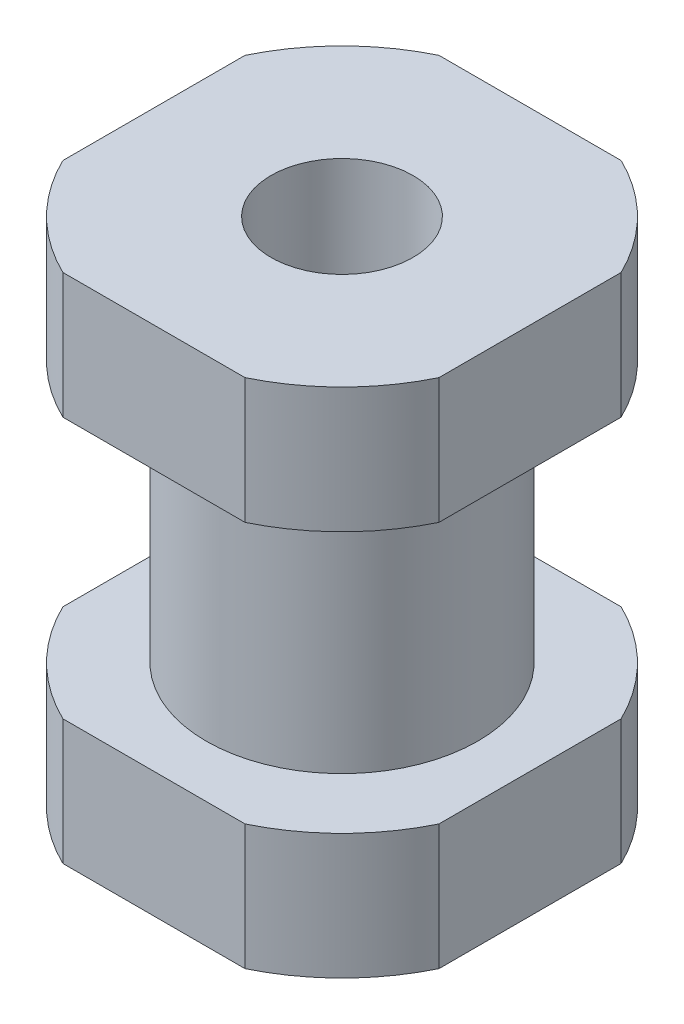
ISO-10303-21;
HEADER;
FILE_DESCRIPTION(('STEP AP214'),'2;1');
FILE_NAME('part.step','',(''),(''),'','','');
FILE_SCHEMA(('AUTOMOTIVE_DESIGN { 1 0 10303 214 1 1 1 1 }'));
ENDSEC;
DATA;
#1=APPLICATION_CONTEXT('core data for automotive mechanical design processes');
#2=APPLICATION_PROTOCOL_DEFINITION('international standard','automotive_design',2000,#1);
#3=PRODUCT_CONTEXT('',#1,'mechanical');
#4=PRODUCT('Part','Part','',(#3));
#5=PRODUCT_RELATED_PRODUCT_CATEGORY('part','',(#4));
#6=PRODUCT_DEFINITION_FORMATION('','',#4);
#7=PRODUCT_DEFINITION_CONTEXT('part definition',#1,'design');
#8=PRODUCT_DEFINITION('design','',#6,#7);
#9=PRODUCT_DEFINITION_SHAPE('','',#8);
#10=(LENGTH_UNIT() NAMED_UNIT(*) SI_UNIT(.MILLI.,.METRE.));
#11=(NAMED_UNIT(*) PLANE_ANGLE_UNIT() SI_UNIT($,.RADIAN.));
#12=(NAMED_UNIT(*) SI_UNIT($,.STERADIAN.) SOLID_ANGLE_UNIT());
#13=UNCERTAINTY_MEASURE_WITH_UNIT(LENGTH_MEASURE(1.E-05),#10,'distance_accuracy_value','');
#14=(GEOMETRIC_REPRESENTATION_CONTEXT(3) GLOBAL_UNCERTAINTY_ASSIGNED_CONTEXT((#13)) GLOBAL_UNIT_ASSIGNED_CONTEXT((#10,
#11,#12)) REPRESENTATION_CONTEXT('',''));
#15=CARTESIAN_POINT('',(0.,0.,0.));
#16=DIRECTION('',(0.,0.,1.));
#17=DIRECTION('',(1.,0.,0.));
#18=AXIS2_PLACEMENT_3D('',#15,#16,#17);
#19=CARTESIAN_POINT('',(-85.2645008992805,-242.832734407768,0.));
#20=DIRECTION('',(0.,-1.,0.));
#21=DIRECTION('',(0.,0.,-1.));
#22=AXIS2_PLACEMENT_3D('',#19,#20,#21);
#23=PLANE('',#22);
#24=CARTESIAN_POINT('',(-85.2645008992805,-242.832734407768,0.));
#25=DIRECTION('',(0.,-1.,0.));
#26=DIRECTION('',(0.,0.,-1.));
#27=AXIS2_PLACEMENT_3D('',#24,#25,#26);
#28=CIRCLE('',#27,3.4);
#29=CARTESIAN_POINT('',(-85.2645008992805,-242.832734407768,-3.4));
#30=VERTEX_POINT('',#29);
#31=EDGE_CURVE('E219',#30,#30,#28,.T.);
#32=ORIENTED_EDGE('',*,*,#31,.T.);
#33=EDGE_LOOP('',(#32));
#34=FACE_BOUND('',#33,.T.);
#35=DIRECTION('',(0.,0.,-1.));
#36=VECTOR('',#35,1.);
#37=CARTESIAN_POINT('',(-94.2645008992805,-242.832734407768,-9.));
#38=LINE('',#37,#36);
#39=CARTESIAN_POINT('',(-94.2645008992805,-242.832734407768,4.35889894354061));
#40=VERTEX_POINT('',#39);
#41=CARTESIAN_POINT('',(-94.2645008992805,-242.832734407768,-4.35889894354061));
#42=VERTEX_POINT('',#41);
#43=EDGE_CURVE('E205',#40,#42,#38,.T.);
#44=ORIENTED_EDGE('',*,*,#43,.F.);
#45=CARTESIAN_POINT('',(-85.2645008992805,-242.832734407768,0.));
#46=DIRECTION('',(0.,-1.,0.));
#47=DIRECTION('',(0.,0.,-1.));
#48=AXIS2_PLACEMENT_3D('',#45,#46,#47);
#49=CIRCLE('',#48,10.);
#50=CARTESIAN_POINT('',(-89.6233998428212,-242.832734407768,9.));
#51=VERTEX_POINT('',#50);
#52=EDGE_CURVE('E214',#51,#40,#49,.T.);
#53=ORIENTED_EDGE('',*,*,#52,.F.);
#54=DIRECTION('',(-1.,0.,0.));
#55=VECTOR('',#54,1.);
#56=CARTESIAN_POINT('',(-76.2645008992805,-242.832734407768,9.));
#57=LINE('',#56,#55);
#58=CARTESIAN_POINT('',(-80.9056019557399,-242.832734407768,9.));
#59=VERTEX_POINT('',#58);
#60=EDGE_CURVE('E149',#59,#51,#57,.T.);
#61=ORIENTED_EDGE('',*,*,#60,.F.);
#62=CARTESIAN_POINT('',(-76.2645008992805,-242.832734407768,4.35889894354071));
#63=VERTEX_POINT('',#62);
#64=EDGE_CURVE('E222',#63,#59,#49,.T.);
#65=ORIENTED_EDGE('',*,*,#64,.F.);
#66=DIRECTION('',(0.,0.,1.));
#67=VECTOR('',#66,1.);
#68=CARTESIAN_POINT('',(-76.2645008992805,-242.832734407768,-9.));
#69=LINE('',#68,#67);
#70=CARTESIAN_POINT('',(-76.2645008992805,-242.832734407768,-4.35889894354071));
#71=VERTEX_POINT('',#70);
#72=EDGE_CURVE('E269',#71,#63,#69,.T.);
#73=ORIENTED_EDGE('',*,*,#72,.F.);
#74=CARTESIAN_POINT('',(-80.9056019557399,-242.832734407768,-9.));
#75=VERTEX_POINT('',#74);
#76=EDGE_CURVE('E138',#75,#71,#49,.T.);
#77=ORIENTED_EDGE('',*,*,#76,.F.);
#78=DIRECTION('',(1.,0.,0.));
#79=VECTOR('',#78,1.);
#80=CARTESIAN_POINT('',(-76.2645008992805,-242.832734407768,-9.));
#81=LINE('',#80,#79);
#82=CARTESIAN_POINT('',(-89.6233998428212,-242.832734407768,-9.));
#83=VERTEX_POINT('',#82);
#84=EDGE_CURVE('E218',#83,#75,#81,.T.);
#85=ORIENTED_EDGE('',*,*,#84,.F.);
#86=EDGE_CURVE('E217',#42,#83,#49,.T.);
#87=ORIENTED_EDGE('',*,*,#86,.F.);
#88=EDGE_LOOP('',(#44,#53,#61,#65,#73,#77,#85,#87));
#89=FACE_BOUND('',#88,.T.);
#90=ADVANCED_FACE('F16',(#34,#89),#23,.F.);
#91=CARTESIAN_POINT('',(-85.2645008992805,-268.929856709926,0.));
#92=DIRECTION('',(0.,-1.,0.));
#93=DIRECTION('',(0.,0.,-1.));
#94=AXIS2_PLACEMENT_3D('',#91,#92,#93);
#95=CYLINDRICAL_SURFACE('',#94,10.);
#96=DIRECTION('',(0.,-1.,0.));
#97=VECTOR('',#96,1.);
#98=CARTESIAN_POINT('',(-94.2645008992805,-268.929856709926,-4.35889894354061));
#99=LINE('',#98,#97);
#100=CARTESIAN_POINT('',(-94.2645008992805,-248.832734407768,-4.35889894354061));
#101=VERTEX_POINT('',#100);
#102=EDGE_CURVE('E30',#42,#101,#99,.T.);
#103=ORIENTED_EDGE('',*,*,#102,.F.);
#104=ORIENTED_EDGE('',*,*,#86,.T.);
#105=DIRECTION('',(0.,-1.,0.));
#106=VECTOR('',#105,1.);
#107=CARTESIAN_POINT('',(-89.6233998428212,-268.929856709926,-9.));
#108=LINE('',#107,#106);
#109=CARTESIAN_POINT('',(-89.6233998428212,-248.832734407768,-9.));
#110=VERTEX_POINT('',#109);
#111=EDGE_CURVE('E278',#110,#83,#108,.F.);
#112=ORIENTED_EDGE('',*,*,#111,.F.);
#113=CARTESIAN_POINT('',(-85.2645008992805,-248.832734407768,0.));
#114=DIRECTION('',(0.,-1.,0.));
#115=DIRECTION('',(0.,0.,-1.));
#116=AXIS2_PLACEMENT_3D('',#113,#114,#115);
#117=CIRCLE('',#116,10.);
#118=EDGE_CURVE('E246',#101,#110,#117,.T.);
#119=ORIENTED_EDGE('',*,*,#118,.F.);
#120=EDGE_LOOP('',(#103,#104,#112,#119));
#121=FACE_BOUND('',#120,.T.);
#122=ADVANCED_FACE('F322',(#121),#95,.T.);
#123=DIRECTION('',(0.,-1.,0.));
#124=VECTOR('',#123,1.);
#125=CARTESIAN_POINT('',(-94.2645008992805,-268.929856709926,4.35889894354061));
#126=LINE('',#125,#124);
#127=CARTESIAN_POINT('',(-94.2645008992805,-248.832734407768,4.35889894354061));
#128=VERTEX_POINT('',#127);
#129=EDGE_CURVE('E158',#128,#40,#126,.F.);
#130=ORIENTED_EDGE('',*,*,#129,.F.);
#131=CARTESIAN_POINT('',(-89.6233998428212,-248.832734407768,9.));
#132=VERTEX_POINT('',#131);
#133=EDGE_CURVE('E250',#132,#128,#117,.T.);
#134=ORIENTED_EDGE('',*,*,#133,.F.);
#135=DIRECTION('',(0.,-1.,0.));
#136=VECTOR('',#135,1.);
#137=CARTESIAN_POINT('',(-89.6233998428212,-268.929856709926,9.));
#138=LINE('',#137,#136);
#139=EDGE_CURVE('E38',#51,#132,#138,.T.);
#140=ORIENTED_EDGE('',*,*,#139,.F.);
#141=ORIENTED_EDGE('',*,*,#52,.T.);
#142=EDGE_LOOP('',(#130,#134,#140,#141));
#143=FACE_BOUND('',#142,.T.);
#144=ADVANCED_FACE('F221',(#143),#95,.T.);
#145=DIRECTION('',(0.,-1.,0.));
#146=VECTOR('',#145,1.);
#147=CARTESIAN_POINT('',(-80.9056019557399,-268.929856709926,9.));
#148=LINE('',#147,#146);
#149=CARTESIAN_POINT('',(-80.9056019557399,-248.832734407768,9.));
#150=VERTEX_POINT('',#149);
#151=EDGE_CURVE('E191',#150,#59,#148,.F.);
#152=ORIENTED_EDGE('',*,*,#151,.F.);
#153=CARTESIAN_POINT('',(-76.2645008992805,-248.832734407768,4.35889894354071));
#154=VERTEX_POINT('',#153);
#155=EDGE_CURVE('E254',#154,#150,#117,.T.);
#156=ORIENTED_EDGE('',*,*,#155,.F.);
#157=DIRECTION('',(0.,-1.,0.));
#158=VECTOR('',#157,1.);
#159=CARTESIAN_POINT('',(-76.2645008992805,-268.929856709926,4.35889894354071));
#160=LINE('',#159,#158);
#161=EDGE_CURVE('E180',#63,#154,#160,.T.);
#162=ORIENTED_EDGE('',*,*,#161,.F.);
#163=ORIENTED_EDGE('',*,*,#64,.T.);
#164=EDGE_LOOP('',(#152,#156,#162,#163));
#165=FACE_BOUND('',#164,.T.);
#166=ADVANCED_FACE('F265',(#165),#95,.T.);
#167=DIRECTION('',(0.,-1.,0.));
#168=VECTOR('',#167,1.);
#169=CARTESIAN_POINT('',(-76.2645008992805,-268.929856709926,-4.35889894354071));
#170=LINE('',#169,#168);
#171=CARTESIAN_POINT('',(-76.2645008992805,-248.832734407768,-4.35889894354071));
#172=VERTEX_POINT('',#171);
#173=EDGE_CURVE('E184',#172,#71,#170,.F.);
#174=ORIENTED_EDGE('',*,*,#173,.F.);
#175=CARTESIAN_POINT('',(-80.9056019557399,-248.832734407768,-9.));
#176=VERTEX_POINT('',#175);
#177=EDGE_CURVE('E225',#176,#172,#117,.T.);
#178=ORIENTED_EDGE('',*,*,#177,.F.);
#179=DIRECTION('',(0.,-1.,0.));
#180=VECTOR('',#179,1.);
#181=CARTESIAN_POINT('',(-80.9056019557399,-268.929856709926,-9.));
#182=LINE('',#181,#180);
#183=EDGE_CURVE('E280',#75,#176,#182,.T.);
#184=ORIENTED_EDGE('',*,*,#183,.F.);
#185=ORIENTED_EDGE('',*,*,#76,.T.);
#186=EDGE_LOOP('',(#174,#178,#184,#185));
#187=FACE_BOUND('',#186,.T.);
#188=ADVANCED_FACE('F293',(#187),#95,.T.);
#189=CARTESIAN_POINT('',(-95.2645008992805,-248.832734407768,0.));
#190=DIRECTION('',(0.,1.,0.));
#191=DIRECTION('',(0.,0.,1.));
#192=AXIS2_PLACEMENT_3D('',#189,#190,#191);
#193=PLANE('',#192);
#194=CARTESIAN_POINT('',(-85.2645008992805,-248.832734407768,0.));
#195=DIRECTION('',(0.,-1.,0.));
#196=DIRECTION('',(0.,0.,-1.));
#197=AXIS2_PLACEMENT_3D('',#194,#195,#196);
#198=CIRCLE('',#197,6.5);
#199=CARTESIAN_POINT('',(-85.2645008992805,-248.832734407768,-6.5));
#200=VERTEX_POINT('',#199);
#201=EDGE_CURVE('E244',#200,#200,#198,.T.);
#202=ORIENTED_EDGE('',*,*,#201,.F.);
#203=EDGE_LOOP('',(#202));
#204=FACE_BOUND('',#203,.T.);
#205=DIRECTION('',(0.,0.,1.));
#206=VECTOR('',#205,1.);
#207=CARTESIAN_POINT('',(-94.2645008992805,-248.832734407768,0.));
#208=LINE('',#207,#206);
#209=EDGE_CURVE('E200',#101,#128,#208,.T.);
#210=ORIENTED_EDGE('',*,*,#209,.F.);
#211=ORIENTED_EDGE('',*,*,#118,.T.);
#212=DIRECTION('',(-1.,0.,0.));
#213=VECTOR('',#212,1.);
#214=CARTESIAN_POINT('',(-95.2645008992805,-248.832734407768,-9.));
#215=LINE('',#214,#213);
#216=EDGE_CURVE('E276',#176,#110,#215,.T.);
#217=ORIENTED_EDGE('',*,*,#216,.F.);
#218=ORIENTED_EDGE('',*,*,#177,.T.);
#219=DIRECTION('',(0.,0.,-1.));
#220=VECTOR('',#219,1.);
#221=CARTESIAN_POINT('',(-76.2645008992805,-248.832734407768,0.));
#222=LINE('',#221,#220);
#223=EDGE_CURVE('E261',#154,#172,#222,.T.);
#224=ORIENTED_EDGE('',*,*,#223,.F.);
#225=ORIENTED_EDGE('',*,*,#155,.T.);
#226=DIRECTION('',(1.,0.,0.));
#227=VECTOR('',#226,1.);
#228=CARTESIAN_POINT('',(-95.2645008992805,-248.832734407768,9.));
#229=LINE('',#228,#227);
#230=EDGE_CURVE('E189',#132,#150,#229,.T.);
#231=ORIENTED_EDGE('',*,*,#230,.F.);
#232=ORIENTED_EDGE('',*,*,#133,.T.);
#233=EDGE_LOOP('',(#210,#211,#217,#218,#224,#225,#231,#232));
#234=FACE_BOUND('',#233,.T.);
#235=ADVANCED_FACE('F260',(#204,#234),#193,.F.);
#236=CARTESIAN_POINT('',(-91.7645008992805,-261.332734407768,0.));
#237=DIRECTION('',(0.,-1.,0.));
#238=DIRECTION('',(0.,0.,-1.));
#239=AXIS2_PLACEMENT_3D('',#236,#237,#238);
#240=PLANE('',#239);
#241=CARTESIAN_POINT('',(-85.2645008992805,-261.332734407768,0.));
#242=DIRECTION('',(0.,-1.,0.));
#243=DIRECTION('',(0.,0.,-1.));
#244=AXIS2_PLACEMENT_3D('',#241,#242,#243);
#245=CIRCLE('',#244,6.5);
#246=CARTESIAN_POINT('',(-85.2645008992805,-261.332734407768,-6.5));
#247=VERTEX_POINT('',#246);
#248=EDGE_CURVE('E242',#247,#247,#245,.T.);
#249=ORIENTED_EDGE('',*,*,#248,.T.);
#250=EDGE_LOOP('',(#249));
#251=FACE_BOUND('',#250,.T.);
#252=DIRECTION('',(0.,0.,-1.));
#253=VECTOR('',#252,1.);
#254=CARTESIAN_POINT('',(-94.2645008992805,-261.332734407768,0.));
#255=LINE('',#254,#253);
#256=CARTESIAN_POINT('',(-94.2645008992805,-261.332734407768,4.35889894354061));
#257=VERTEX_POINT('',#256);
#258=CARTESIAN_POINT('',(-94.2645008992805,-261.332734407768,-4.35889894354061));
#259=VERTEX_POINT('',#258);
#260=EDGE_CURVE('E196',#257,#259,#255,.T.);
#261=ORIENTED_EDGE('',*,*,#260,.F.);
#262=CARTESIAN_POINT('',(-85.2645008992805,-261.332734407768,0.));
#263=DIRECTION('',(0.,-1.,0.));
#264=DIRECTION('',(0.,0.,-1.));
#265=AXIS2_PLACEMENT_3D('',#262,#263,#264);
#266=CIRCLE('',#265,10.);
#267=CARTESIAN_POINT('',(-89.6233998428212,-261.332734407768,9.));
#268=VERTEX_POINT('',#267);
#269=EDGE_CURVE('E162',#268,#257,#266,.T.);
#270=ORIENTED_EDGE('',*,*,#269,.F.);
#271=DIRECTION('',(-1.,0.,0.));
#272=VECTOR('',#271,1.);
#273=CARTESIAN_POINT('',(-91.7645008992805,-261.332734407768,9.));
#274=LINE('',#273,#272);
#275=CARTESIAN_POINT('',(-80.9056019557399,-261.332734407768,9.));
#276=VERTEX_POINT('',#275);
#277=EDGE_CURVE('E179',#276,#268,#274,.T.);
#278=ORIENTED_EDGE('',*,*,#277,.F.);
#279=CARTESIAN_POINT('',(-76.2645008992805,-261.332734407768,4.35889894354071));
#280=VERTEX_POINT('',#279);
#281=EDGE_CURVE('E176',#280,#276,#266,.T.);
#282=ORIENTED_EDGE('',*,*,#281,.F.);
#283=DIRECTION('',(0.,0.,1.));
#284=VECTOR('',#283,1.);
#285=CARTESIAN_POINT('',(-76.2645008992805,-261.332734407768,0.));
#286=LINE('',#285,#284);
#287=CARTESIAN_POINT('',(-76.2645008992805,-261.332734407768,-4.35889894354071));
#288=VERTEX_POINT('',#287);
#289=EDGE_CURVE('E284',#288,#280,#286,.T.);
#290=ORIENTED_EDGE('',*,*,#289,.F.);
#291=CARTESIAN_POINT('',(-80.9056019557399,-261.332734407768,-9.));
#292=VERTEX_POINT('',#291);
#293=EDGE_CURVE('E163',#292,#288,#266,.T.);
#294=ORIENTED_EDGE('',*,*,#293,.F.);
#295=DIRECTION('',(1.,0.,0.));
#296=VECTOR('',#295,1.);
#297=CARTESIAN_POINT('',(-91.7645008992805,-261.332734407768,-9.));
#298=LINE('',#297,#296);
#299=CARTESIAN_POINT('',(-89.6233998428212,-261.332734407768,-9.));
#300=VERTEX_POINT('',#299);
#301=EDGE_CURVE('E148',#300,#292,#298,.T.);
#302=ORIENTED_EDGE('',*,*,#301,.F.);
#303=EDGE_CURVE('E147',#259,#300,#266,.T.);
#304=ORIENTED_EDGE('',*,*,#303,.F.);
#305=EDGE_LOOP('',(#261,#270,#278,#282,#290,#294,#302,#304));
#306=FACE_BOUND('',#305,.T.);
#307=ADVANCED_FACE('F239',(#251,#306),#240,.F.);
#308=CARTESIAN_POINT('',(-85.2645008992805,-268.929856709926,0.));
#309=DIRECTION('',(0.,-1.,0.));
#310=DIRECTION('',(0.,0.,-1.));
#311=AXIS2_PLACEMENT_3D('',#308,#309,#310);
#312=CYLINDRICAL_SURFACE('',#311,10.);
#313=DIRECTION('',(0.,-1.,0.));
#314=VECTOR('',#313,1.);
#315=CARTESIAN_POINT('',(-94.2645008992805,-268.929856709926,-4.35889894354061));
#316=LINE('',#315,#314);
#317=CARTESIAN_POINT('',(-94.2645008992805,-267.332734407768,-4.35889894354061));
#318=VERTEX_POINT('',#317);
#319=EDGE_CURVE('E198',#259,#318,#316,.T.);
#320=ORIENTED_EDGE('',*,*,#319,.F.);
#321=ORIENTED_EDGE('',*,*,#303,.T.);
#322=DIRECTION('',(0.,-1.,0.));
#323=VECTOR('',#322,1.);
#324=CARTESIAN_POINT('',(-89.6233998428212,-268.929856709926,-9.));
#325=LINE('',#324,#323);
#326=CARTESIAN_POINT('',(-89.6233998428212,-267.332734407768,-9.));
#327=VERTEX_POINT('',#326);
#328=EDGE_CURVE('E129',#327,#300,#325,.F.);
#329=ORIENTED_EDGE('',*,*,#328,.F.);
#330=CARTESIAN_POINT('',(-85.2645008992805,-267.332734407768,0.));
#331=DIRECTION('',(0.,-1.,0.));
#332=DIRECTION('',(0.,0.,-1.));
#333=AXIS2_PLACEMENT_3D('',#330,#331,#332);
#334=CIRCLE('',#333,10.);
#335=EDGE_CURVE('E145',#318,#327,#334,.T.);
#336=ORIENTED_EDGE('',*,*,#335,.F.);
#337=EDGE_LOOP('',(#320,#321,#329,#336));
#338=FACE_BOUND('',#337,.T.);
#339=ADVANCED_FACE('F144',(#338),#312,.T.);
#340=DIRECTION('',(0.,-1.,0.));
#341=VECTOR('',#340,1.);
#342=CARTESIAN_POINT('',(-94.2645008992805,-268.929856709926,4.35889894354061));
#343=LINE('',#342,#341);
#344=CARTESIAN_POINT('',(-94.2645008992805,-267.332734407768,4.35889894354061));
#345=VERTEX_POINT('',#344);
#346=EDGE_CURVE('E194',#345,#257,#343,.F.);
#347=ORIENTED_EDGE('',*,*,#346,.F.);
#348=CARTESIAN_POINT('',(-89.6233998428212,-267.332734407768,9.));
#349=VERTEX_POINT('',#348);
#350=EDGE_CURVE('E154',#349,#345,#334,.T.);
#351=ORIENTED_EDGE('',*,*,#350,.F.);
#352=DIRECTION('',(0.,-1.,0.));
#353=VECTOR('',#352,1.);
#354=CARTESIAN_POINT('',(-89.6233998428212,-268.929856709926,9.));
#355=LINE('',#354,#353);
#356=EDGE_CURVE('E182',#268,#349,#355,.T.);
#357=ORIENTED_EDGE('',*,*,#356,.F.);
#358=ORIENTED_EDGE('',*,*,#269,.T.);
#359=EDGE_LOOP('',(#347,#351,#357,#358));
#360=FACE_BOUND('',#359,.T.);
#361=ADVANCED_FACE('F236',(#360),#312,.T.);
#362=DIRECTION('',(0.,-1.,0.));
#363=VECTOR('',#362,1.);
#364=CARTESIAN_POINT('',(-80.9056019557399,-268.929856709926,9.));
#365=LINE('',#364,#363);
#366=CARTESIAN_POINT('',(-80.9056019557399,-267.332734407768,9.));
#367=VERTEX_POINT('',#366);
#368=EDGE_CURVE('E175',#367,#276,#365,.F.);
#369=ORIENTED_EDGE('',*,*,#368,.F.);
#370=CARTESIAN_POINT('',(-76.2645008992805,-267.332734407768,4.35889894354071));
#371=VERTEX_POINT('',#370);
#372=EDGE_CURVE('E157',#371,#367,#334,.T.);
#373=ORIENTED_EDGE('',*,*,#372,.F.);
#374=DIRECTION('',(0.,-1.,0.));
#375=VECTOR('',#374,1.);
#376=CARTESIAN_POINT('',(-76.2645008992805,-268.929856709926,4.35889894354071));
#377=LINE('',#376,#375);
#378=EDGE_CURVE('E173',#280,#371,#377,.T.);
#379=ORIENTED_EDGE('',*,*,#378,.F.);
#380=ORIENTED_EDGE('',*,*,#281,.T.);
#381=EDGE_LOOP('',(#369,#373,#379,#380));
#382=FACE_BOUND('',#381,.T.);
#383=ADVANCED_FACE('F171',(#382),#312,.T.);
#384=DIRECTION('',(0.,-1.,0.));
#385=VECTOR('',#384,1.);
#386=CARTESIAN_POINT('',(-76.2645008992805,-268.929856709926,-4.35889894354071));
#387=LINE('',#386,#385);
#388=CARTESIAN_POINT('',(-76.2645008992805,-267.332734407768,-4.35889894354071));
#389=VERTEX_POINT('',#388);
#390=EDGE_CURVE('E282',#389,#288,#387,.F.);
#391=ORIENTED_EDGE('',*,*,#390,.F.);
#392=CARTESIAN_POINT('',(-80.9056019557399,-267.332734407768,-9.));
#393=VERTEX_POINT('',#392);
#394=EDGE_CURVE('E156',#393,#389,#334,.T.);
#395=ORIENTED_EDGE('',*,*,#394,.F.);
#396=DIRECTION('',(0.,-1.,0.));
#397=VECTOR('',#396,1.);
#398=CARTESIAN_POINT('',(-80.9056019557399,-268.929856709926,-9.));
#399=LINE('',#398,#397);
#400=EDGE_CURVE('E132',#292,#393,#399,.T.);
#401=ORIENTED_EDGE('',*,*,#400,.F.);
#402=ORIENTED_EDGE('',*,*,#293,.T.);
#403=EDGE_LOOP('',(#391,#395,#401,#402));
#404=FACE_BOUND('',#403,.T.);
#405=ADVANCED_FACE('F308',(#404),#312,.T.);
#406=CARTESIAN_POINT('',(-95.2645008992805,-267.332734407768,0.));
#407=DIRECTION('',(0.,1.,0.));
#408=DIRECTION('',(0.,0.,1.));
#409=AXIS2_PLACEMENT_3D('',#406,#407,#408);
#410=PLANE('',#409);
#411=CARTESIAN_POINT('',(-85.2645008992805,-267.332734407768,0.));
#412=DIRECTION('',(0.,-1.,0.));
#413=DIRECTION('',(0.,0.,-1.));
#414=AXIS2_PLACEMENT_3D('',#411,#412,#413);
#415=CIRCLE('',#414,3.4);
#416=CARTESIAN_POINT('',(-85.2645008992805,-267.332734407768,-3.4));
#417=VERTEX_POINT('',#416);
#418=EDGE_CURVE('E300',#417,#417,#415,.T.);
#419=ORIENTED_EDGE('',*,*,#418,.F.);
#420=EDGE_LOOP('',(#419));
#421=FACE_BOUND('',#420,.T.);
#422=DIRECTION('',(0.,0.,1.));
#423=VECTOR('',#422,1.);
#424=CARTESIAN_POINT('',(-94.2645008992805,-267.332734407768,0.));
#425=LINE('',#424,#423);
#426=EDGE_CURVE('E11',#318,#345,#425,.T.);
#427=ORIENTED_EDGE('',*,*,#426,.F.);
#428=ORIENTED_EDGE('',*,*,#335,.T.);
#429=DIRECTION('',(-1.,0.,0.));
#430=VECTOR('',#429,1.);
#431=CARTESIAN_POINT('',(-95.2645008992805,-267.332734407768,-9.));
#432=LINE('',#431,#430);
#433=EDGE_CURVE('E126',#393,#327,#432,.T.);
#434=ORIENTED_EDGE('',*,*,#433,.F.);
#435=ORIENTED_EDGE('',*,*,#394,.T.);
#436=DIRECTION('',(0.,0.,-1.));
#437=VECTOR('',#436,1.);
#438=CARTESIAN_POINT('',(-76.2645008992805,-267.332734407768,0.));
#439=LINE('',#438,#437);
#440=EDGE_CURVE('E137',#371,#389,#439,.T.);
#441=ORIENTED_EDGE('',*,*,#440,.F.);
#442=ORIENTED_EDGE('',*,*,#372,.T.);
#443=DIRECTION('',(1.,0.,0.));
#444=VECTOR('',#443,1.);
#445=CARTESIAN_POINT('',(-95.2645008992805,-267.332734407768,9.));
#446=LINE('',#445,#444);
#447=EDGE_CURVE('E23',#349,#367,#446,.T.);
#448=ORIENTED_EDGE('',*,*,#447,.F.);
#449=ORIENTED_EDGE('',*,*,#350,.T.);
#450=EDGE_LOOP('',(#427,#428,#434,#435,#441,#442,#448,#449));
#451=FACE_BOUND('',#450,.T.);
#452=ADVANCED_FACE('F152',(#421,#451),#410,.F.);
#453=CARTESIAN_POINT('',(-85.2645008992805,-268.929856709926,0.));
#454=DIRECTION('',(0.,-1.,0.));
#455=DIRECTION('',(0.,0.,-1.));
#456=AXIS2_PLACEMENT_3D('',#453,#454,#455);
#457=CYLINDRICAL_SURFACE('',#456,6.5);
#458=ORIENTED_EDGE('',*,*,#248,.F.);
#459=EDGE_LOOP('',(#458));
#460=FACE_BOUND('',#459,.T.);
#461=ORIENTED_EDGE('',*,*,#201,.T.);
#462=EDGE_LOOP('',(#461));
#463=FACE_BOUND('',#462,.T.);
#464=ADVANCED_FACE('F307',(#460,#463),#457,.T.);
#465=CARTESIAN_POINT('',(-76.2645008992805,-242.832734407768,-9.));
#466=DIRECTION('',(0.,0.,-1.));
#467=DIRECTION('',(-1.,0.,0.));
#468=AXIS2_PLACEMENT_3D('',#465,#466,#467);
#469=PLANE('',#468);
#470=ORIENTED_EDGE('',*,*,#400,.T.);
#471=ORIENTED_EDGE('',*,*,#433,.T.);
#472=ORIENTED_EDGE('',*,*,#328,.T.);
#473=ORIENTED_EDGE('',*,*,#301,.T.);
#474=EDGE_LOOP('',(#470,#471,#472,#473));
#475=FACE_BOUND('',#474,.T.);
#476=ADVANCED_FACE('F128',(#475),#469,.T.);
#477=CARTESIAN_POINT('',(-76.2645008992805,-242.832734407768,-9.));
#478=DIRECTION('',(1.,0.,0.));
#479=DIRECTION('',(0.,0.,-1.));
#480=AXIS2_PLACEMENT_3D('',#477,#478,#479);
#481=PLANE('',#480);
#482=ORIENTED_EDGE('',*,*,#378,.T.);
#483=ORIENTED_EDGE('',*,*,#440,.T.);
#484=ORIENTED_EDGE('',*,*,#390,.T.);
#485=ORIENTED_EDGE('',*,*,#289,.T.);
#486=EDGE_LOOP('',(#482,#483,#484,#485));
#487=FACE_BOUND('',#486,.T.);
#488=ADVANCED_FACE('F344',(#487),#481,.T.);
#489=CARTESIAN_POINT('',(-76.2645008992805,-242.832734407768,9.));
#490=DIRECTION('',(0.,0.,1.));
#491=DIRECTION('',(1.,0.,0.));
#492=AXIS2_PLACEMENT_3D('',#489,#490,#491);
#493=PLANE('',#492);
#494=ORIENTED_EDGE('',*,*,#356,.T.);
#495=ORIENTED_EDGE('',*,*,#447,.T.);
#496=ORIENTED_EDGE('',*,*,#368,.T.);
#497=ORIENTED_EDGE('',*,*,#277,.T.);
#498=EDGE_LOOP('',(#494,#495,#496,#497));
#499=FACE_BOUND('',#498,.T.);
#500=ADVANCED_FACE('F230',(#499),#493,.T.);
#501=CARTESIAN_POINT('',(-94.2645008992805,-242.832734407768,-9.));
#502=DIRECTION('',(-1.,0.,0.));
#503=DIRECTION('',(0.,0.,1.));
#504=AXIS2_PLACEMENT_3D('',#501,#502,#503);
#505=PLANE('',#504);
#506=ORIENTED_EDGE('',*,*,#319,.T.);
#507=ORIENTED_EDGE('',*,*,#426,.T.);
#508=ORIENTED_EDGE('',*,*,#346,.T.);
#509=ORIENTED_EDGE('',*,*,#260,.T.);
#510=EDGE_LOOP('',(#506,#507,#508,#509));
#511=FACE_BOUND('',#510,.T.);
#512=ADVANCED_FACE('F338',(#511),#505,.T.);
#513=ORIENTED_EDGE('',*,*,#183,.T.);
#514=ORIENTED_EDGE('',*,*,#216,.T.);
#515=ORIENTED_EDGE('',*,*,#111,.T.);
#516=ORIENTED_EDGE('',*,*,#84,.T.);
#517=EDGE_LOOP('',(#513,#514,#515,#516));
#518=FACE_BOUND('',#517,.T.);
#519=ADVANCED_FACE('F295',(#518),#469,.T.);
#520=ORIENTED_EDGE('',*,*,#161,.T.);
#521=ORIENTED_EDGE('',*,*,#223,.T.);
#522=ORIENTED_EDGE('',*,*,#173,.T.);
#523=ORIENTED_EDGE('',*,*,#72,.T.);
#524=EDGE_LOOP('',(#520,#521,#522,#523));
#525=FACE_BOUND('',#524,.T.);
#526=ADVANCED_FACE('F289',(#525),#481,.T.);
#527=ORIENTED_EDGE('',*,*,#139,.T.);
#528=ORIENTED_EDGE('',*,*,#230,.T.);
#529=ORIENTED_EDGE('',*,*,#151,.T.);
#530=ORIENTED_EDGE('',*,*,#60,.T.);
#531=EDGE_LOOP('',(#527,#528,#529,#530));
#532=FACE_BOUND('',#531,.T.);
#533=ADVANCED_FACE('F267',(#532),#493,.T.);
#534=ORIENTED_EDGE('',*,*,#102,.T.);
#535=ORIENTED_EDGE('',*,*,#209,.T.);
#536=ORIENTED_EDGE('',*,*,#129,.T.);
#537=ORIENTED_EDGE('',*,*,#43,.T.);
#538=EDGE_LOOP('',(#534,#535,#536,#537));
#539=FACE_BOUND('',#538,.T.);
#540=ADVANCED_FACE('F204',(#539),#505,.T.);
#541=CARTESIAN_POINT('',(-85.2645008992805,-267.332734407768,0.));
#542=DIRECTION('',(0.,-1.,0.));
#543=DIRECTION('',(0.,0.,-1.));
#544=AXIS2_PLACEMENT_3D('',#541,#542,#543);
#545=CYLINDRICAL_SURFACE('',#544,3.4);
#546=ORIENTED_EDGE('',*,*,#31,.F.);
#547=EDGE_LOOP('',(#546));
#548=FACE_BOUND('',#547,.T.);
#549=ORIENTED_EDGE('',*,*,#418,.T.);
#550=EDGE_LOOP('',(#549));
#551=FACE_BOUND('',#550,.T.);
#552=ADVANCED_FACE('F304',(#548,#551),#545,.F.);
#553=CLOSED_SHELL('',(#90,#122,#144,#166,#188,#235,#307,#339,#361,#383,#405,#452,#464,#476,#488,
#500,#512,#519,#526,#533,#540,#552));
#554=MANIFOLD_SOLID_BREP('B1',#553);
#555=ADVANCED_BREP_SHAPE_REPRESENTATION('',(#18,#554),#14);
#556=SHAPE_DEFINITION_REPRESENTATION(#9,#555);
ENDSEC;
END-ISO-10303-21;
